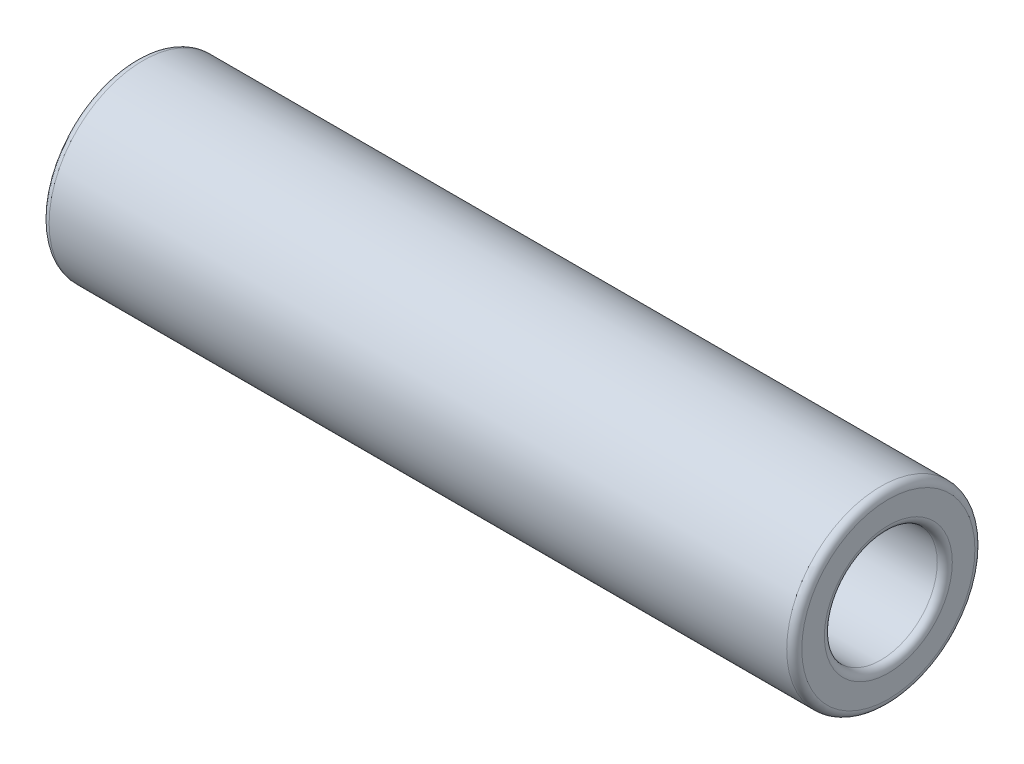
from build123d import *

# Parameters (mm, degrees)
SKETCH1_R           = 6.25
SKETCH1_R_2         = 3.75
BOSS_EXTRUDE1_DEPTH = 50
FILLET1_R           = 0.5


with BuildPart() as part:
    # Sketch1 → Boss-Extrude1 (new body)
    with BuildSketch(Plane(origin=(0, 0, 0), x_dir=(0, 0, -1), z_dir=(1, 0, 0))):
        Circle(SKETCH1_R)
        Circle(SKETCH1_R_2, mode=Mode.SUBTRACT)
    extrude(amount=BOSS_EXTRUDE1_DEPTH)

    # Fillet1
    fillet1_edges = [part.edges().sort_by_distance(p)[0] for p in [
        (0, 0, 6.25),
        (50, 0, 6.25),
        (0, 0, 3.75),
        (50, 0, 3.75),
    ]]
    fillet(fillet1_edges, radius=FILLET1_R)


solid = part.part
